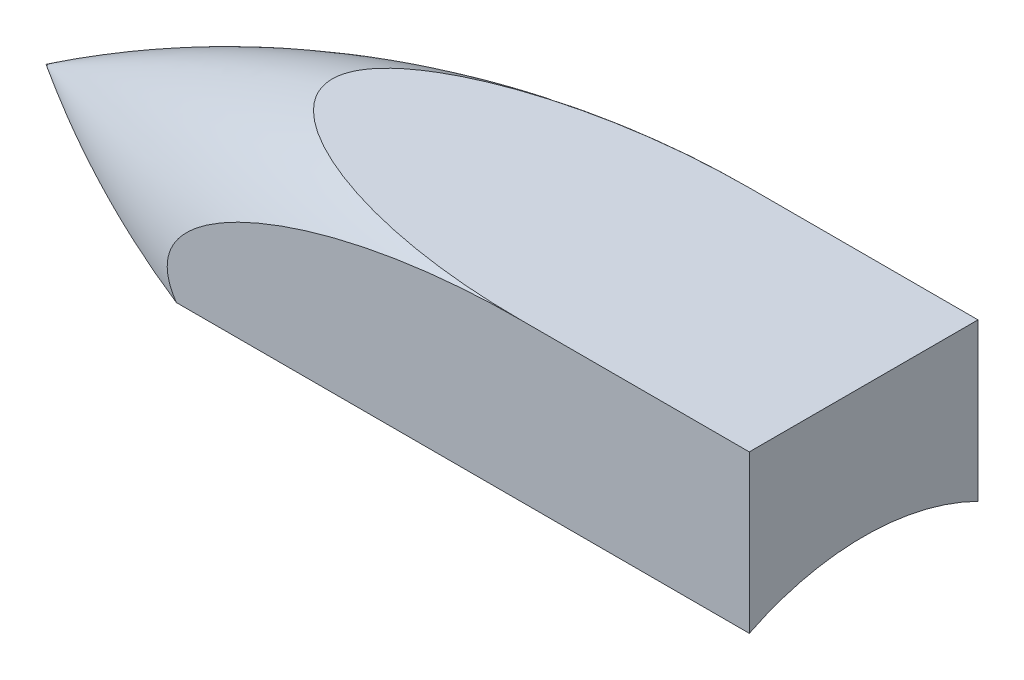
from build123d import *

# Parameters (mm, degrees)
SKETCH1_R          = 19.258828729
EXTRUDE1_DEPTH     = 25.4
CUT_EXTRUDE1_DEPTH = 95.805923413


with BuildPart() as part:
    # Sketch1 → Extrude1 (new body)
    with BuildSketch(Plane(origin=(0, 0, 0), x_dir=(0, 0, -1), z_dir=(1, 0, 0))):
        Circle(SKETCH1_R)
    extrude(amount=EXTRUDE1_DEPTH)

    # Sketch7 → Revolve3 (revolve)
    with BuildSketch(Plane.XY):
        with BuildLine():
            Line((0, 0), (0, 19.258828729))
            ThreePointArc((0, 19.258828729), (-34.092887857, 14.344064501), (-65.409460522, 0))
            Line((-65.409460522, 0), (0, 0))
        make_face()
    revolve(axis=Axis((0, 0, 0), (-1, 0, 0)))

    # Sketch8 → Cut-Extrude1 (cut, through all)
    with BuildSketch(Plane(origin=(25.4, 0, 0), x_dir=(0, 0, -1), z_dir=(1, 0, 0))):
        with BuildLine():
            Line((-12.7, -2.977331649), (-12.7, 14.478))
            ThreePointArc((-12.7, 14.478), (-7.947180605, -17.542656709), (19.258828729, 0))
            ThreePointArc((19.258828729, 0), (17.542656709, 7.947180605), (12.7, 14.478))
            Line((12.7, 14.478), (12.7, -2.977331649))
            ThreePointArc((12.7, -2.977331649), (0, 0), (-12.7, -2.977331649))
        make_face()
        with BuildLine():
            ThreePointArc((12.7, 14.478), (0, 19.258828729), (-12.7, 14.478))
            Line((-12.7, 14.478), (12.7, 14.478))
        make_face()
    extrude(amount=-CUT_EXTRUDE1_DEPTH, mode=Mode.SUBTRACT)


solid = part.part
